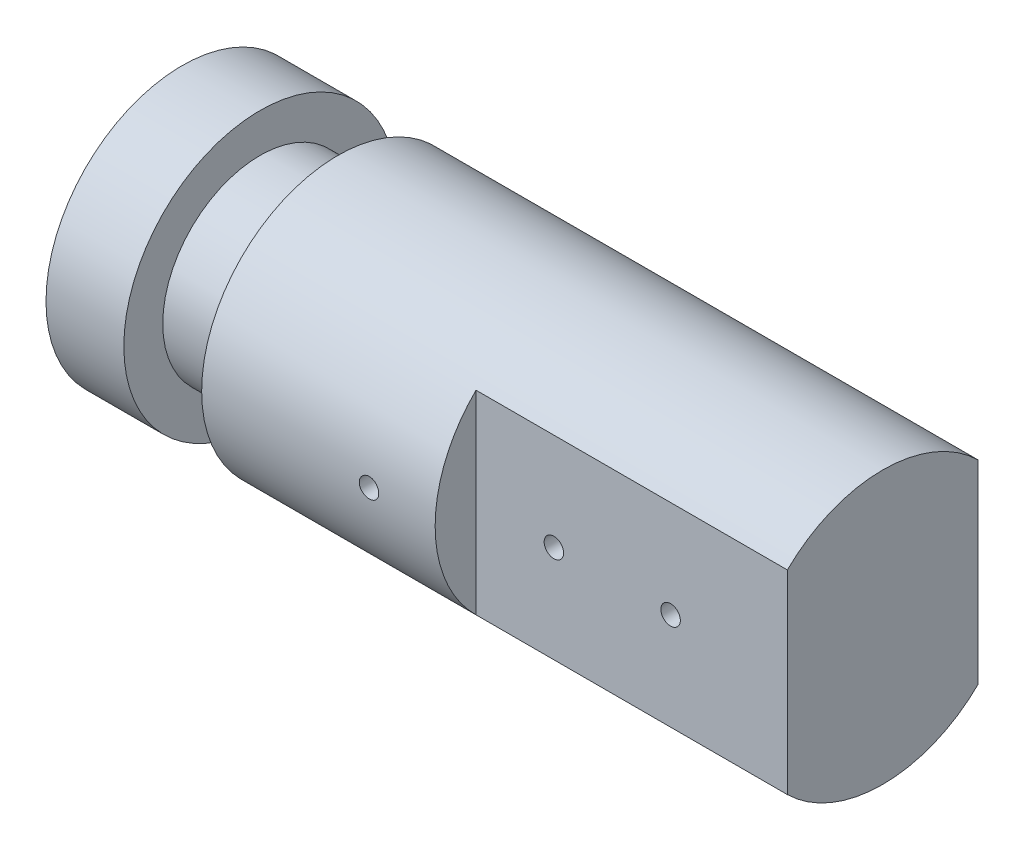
ISO-10303-21;
HEADER;
FILE_DESCRIPTION(('STEP AP214'),'2;1');
FILE_NAME('part.step','',(''),(''),'','','');
FILE_SCHEMA(('AUTOMOTIVE_DESIGN { 1 0 10303 214 1 1 1 1 }'));
ENDSEC;
DATA;
#1=APPLICATION_CONTEXT('core data for automotive mechanical design processes');
#2=APPLICATION_PROTOCOL_DEFINITION('international standard','automotive_design',2000,#1);
#3=PRODUCT_CONTEXT('',#1,'mechanical');
#4=PRODUCT('Part','Part','',(#3));
#5=PRODUCT_RELATED_PRODUCT_CATEGORY('part','',(#4));
#6=PRODUCT_DEFINITION_FORMATION('','',#4);
#7=PRODUCT_DEFINITION_CONTEXT('part definition',#1,'design');
#8=PRODUCT_DEFINITION('design','',#6,#7);
#9=PRODUCT_DEFINITION_SHAPE('','',#8);
#10=(LENGTH_UNIT() NAMED_UNIT(*) SI_UNIT(.MILLI.,.METRE.));
#11=(NAMED_UNIT(*) PLANE_ANGLE_UNIT() SI_UNIT($,.RADIAN.));
#12=(NAMED_UNIT(*) SI_UNIT($,.STERADIAN.) SOLID_ANGLE_UNIT());
#13=UNCERTAINTY_MEASURE_WITH_UNIT(LENGTH_MEASURE(1.E-05),#10,'distance_accuracy_value','');
#14=(GEOMETRIC_REPRESENTATION_CONTEXT(3) GLOBAL_UNCERTAINTY_ASSIGNED_CONTEXT((#13)) GLOBAL_UNIT_ASSIGNED_CONTEXT((#10,
#11,#12)) REPRESENTATION_CONTEXT('',''));
#15=CARTESIAN_POINT('',(0.,0.,0.));
#16=DIRECTION('',(0.,0.,1.));
#17=DIRECTION('',(1.,0.,0.));
#18=AXIS2_PLACEMENT_3D('',#15,#16,#17);
#19=CARTESIAN_POINT('',(50.,17.5,0.));
#20=DIRECTION('',(-1.,0.,0.));
#21=DIRECTION('',(0.,0.,1.));
#22=AXIS2_PLACEMENT_3D('',#19,#20,#21);
#23=PLANE('',#22);
#24=DIRECTION('',(0.,-1.,0.));
#25=VECTOR('',#24,1.);
#26=CARTESIAN_POINT('',(50.,-12.5,12.2474487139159));
#27=LINE('',#26,#25);
#28=CARTESIAN_POINT('',(50.,12.5,12.2474487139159));
#29=VERTEX_POINT('',#28);
#30=CARTESIAN_POINT('',(50.,-12.5,12.2474487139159));
#31=VERTEX_POINT('',#30);
#32=EDGE_CURVE('E139',#29,#31,#27,.T.);
#33=ORIENTED_EDGE('',*,*,#32,.F.);
#34=CARTESIAN_POINT('',(50.,0.,0.));
#35=DIRECTION('',(-1.,0.,0.));
#36=DIRECTION('',(0.,0.,1.));
#37=AXIS2_PLACEMENT_3D('',#34,#35,#36);
#38=CIRCLE('',#37,17.5);
#39=EDGE_CURVE('E62',#31,#29,#38,.T.);
#40=ORIENTED_EDGE('',*,*,#39,.F.);
#41=EDGE_LOOP('',(#33,#40));
#42=FACE_BOUND('',#41,.T.);
#43=ADVANCED_FACE('F43',(#42),#23,.F.);
#44=DIRECTION('',(0.,1.,0.));
#45=VECTOR('',#44,1.);
#46=CARTESIAN_POINT('',(50.,-12.5,-12.2474487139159));
#47=LINE('',#46,#45);
#48=CARTESIAN_POINT('',(50.,-12.5,-12.2474487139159));
#49=VERTEX_POINT('',#48);
#50=CARTESIAN_POINT('',(50.,12.5,-12.2474487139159));
#51=VERTEX_POINT('',#50);
#52=EDGE_CURVE('E69',#49,#51,#47,.T.);
#53=ORIENTED_EDGE('',*,*,#52,.F.);
#54=EDGE_CURVE('E163',#51,#49,#38,.T.);
#55=ORIENTED_EDGE('',*,*,#54,.F.);
#56=EDGE_LOOP('',(#53,#55));
#57=FACE_BOUND('',#56,.T.);
#58=ADVANCED_FACE('F237',(#57),#23,.F.);
#59=CARTESIAN_POINT('',(0.,0.,0.));
#60=DIRECTION('',(1.,0.,0.));
#61=DIRECTION('',(0.,0.,-1.));
#62=AXIS2_PLACEMENT_3D('',#59,#60,#61);
#63=PLANE('',#62);
#64=CARTESIAN_POINT('',(0.,0.,0.));
#65=DIRECTION('',(-1.,0.,0.));
#66=DIRECTION('',(0.,0.,1.));
#67=AXIS2_PLACEMENT_3D('',#64,#65,#66);
#68=CIRCLE('',#67,17.5);
#69=CARTESIAN_POINT('',(0.,0.,17.5));
#70=VERTEX_POINT('',#69);
#71=EDGE_CURVE('E56',#70,#70,#68,.T.);
#72=ORIENTED_EDGE('',*,*,#71,.T.);
#73=EDGE_LOOP('',(#72));
#74=FACE_BOUND('',#73,.T.);
#75=ADVANCED_FACE('F45',(#74),#63,.F.);
#76=CARTESIAN_POINT('',(0.,0.,0.));
#77=DIRECTION('',(-1.,0.,0.));
#78=DIRECTION('',(0.,0.,1.));
#79=AXIS2_PLACEMENT_3D('',#76,#77,#78);
#80=CYLINDRICAL_SURFACE('',#79,17.5);
#81=ORIENTED_EDGE('',*,*,#71,.F.);
#82=EDGE_LOOP('',(#81));
#83=FACE_BOUND('',#82,.T.);
#84=CARTESIAN_POINT('',(10.,0.,0.));
#85=DIRECTION('',(-1.,0.,0.));
#86=DIRECTION('',(0.,0.,1.));
#87=AXIS2_PLACEMENT_3D('',#84,#85,#86);
#88=CIRCLE('',#87,17.5);
#89=CARTESIAN_POINT('',(10.,0.,17.5));
#90=VERTEX_POINT('',#89);
#91=EDGE_CURVE('E173',#90,#90,#88,.T.);
#92=ORIENTED_EDGE('',*,*,#91,.T.);
#93=EDGE_LOOP('',(#92));
#94=FACE_BOUND('',#93,.T.);
#95=ADVANCED_FACE('F179',(#83,#94),#80,.T.);
#96=CARTESIAN_POINT('',(10.,17.5,0.));
#97=DIRECTION('',(-1.,0.,0.));
#98=DIRECTION('',(0.,0.,1.));
#99=AXIS2_PLACEMENT_3D('',#96,#97,#98);
#100=PLANE('',#99);
#101=ORIENTED_EDGE('',*,*,#91,.F.);
#102=EDGE_LOOP('',(#101));
#103=FACE_BOUND('',#102,.T.);
#104=CARTESIAN_POINT('',(10.,0.,0.));
#105=DIRECTION('',(-1.,0.,0.));
#106=DIRECTION('',(0.,0.,1.));
#107=AXIS2_PLACEMENT_3D('',#104,#105,#106);
#108=CIRCLE('',#107,12.5);
#109=CARTESIAN_POINT('',(10.,0.,12.5));
#110=VERTEX_POINT('',#109);
#111=EDGE_CURVE('E170',#110,#110,#108,.T.);
#112=ORIENTED_EDGE('',*,*,#111,.T.);
#113=EDGE_LOOP('',(#112));
#114=FACE_BOUND('',#113,.T.);
#115=ADVANCED_FACE('F182',(#103,#114),#100,.F.);
#116=CARTESIAN_POINT('',(0.,0.,0.));
#117=DIRECTION('',(-1.,0.,0.));
#118=DIRECTION('',(0.,0.,1.));
#119=AXIS2_PLACEMENT_3D('',#116,#117,#118);
#120=CYLINDRICAL_SURFACE('',#119,12.5);
#121=ORIENTED_EDGE('',*,*,#111,.F.);
#122=EDGE_LOOP('',(#121));
#123=FACE_BOUND('',#122,.T.);
#124=CARTESIAN_POINT('',(20.,0.,0.));
#125=DIRECTION('',(-1.,0.,0.));
#126=DIRECTION('',(0.,0.,1.));
#127=AXIS2_PLACEMENT_3D('',#124,#125,#126);
#128=CIRCLE('',#127,12.5);
#129=CARTESIAN_POINT('',(20.,0.,12.5));
#130=VERTEX_POINT('',#129);
#131=EDGE_CURVE('E167',#130,#130,#128,.T.);
#132=ORIENTED_EDGE('',*,*,#131,.T.);
#133=EDGE_LOOP('',(#132));
#134=FACE_BOUND('',#133,.T.);
#135=ADVANCED_FACE('F187',(#123,#134),#120,.T.);
#136=CARTESIAN_POINT('',(20.,12.5,0.));
#137=DIRECTION('',(1.,0.,0.));
#138=DIRECTION('',(0.,0.,-1.));
#139=AXIS2_PLACEMENT_3D('',#136,#137,#138);
#140=PLANE('',#139);
#141=ORIENTED_EDGE('',*,*,#131,.F.);
#142=EDGE_LOOP('',(#141));
#143=FACE_BOUND('',#142,.T.);
#144=CARTESIAN_POINT('',(20.,0.,0.));
#145=DIRECTION('',(-1.,0.,0.));
#146=DIRECTION('',(0.,0.,1.));
#147=AXIS2_PLACEMENT_3D('',#144,#145,#146);
#148=CIRCLE('',#147,17.5);
#149=CARTESIAN_POINT('',(20.,0.,17.5));
#150=VERTEX_POINT('',#149);
#151=EDGE_CURVE('E164',#150,#150,#148,.T.);
#152=ORIENTED_EDGE('',*,*,#151,.T.);
#153=EDGE_LOOP('',(#152));
#154=FACE_BOUND('',#153,.T.);
#155=ADVANCED_FACE('F193',(#143,#154),#140,.F.);
#156=CARTESIAN_POINT('',(0.,0.,0.));
#157=DIRECTION('',(-1.,0.,0.));
#158=DIRECTION('',(0.,0.,1.));
#159=AXIS2_PLACEMENT_3D('',#156,#157,#158);
#160=CYLINDRICAL_SURFACE('',#159,17.5);
#161=CARTESIAN_POINT('',(42.75,0.,17.5));
#162=CARTESIAN_POINT('',(42.7499969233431,-0.0701171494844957,17.4999994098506));
#163=CARTESIAN_POINT('',(42.7440804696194,-0.14028285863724,17.4995740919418));
#164=CARTESIAN_POINT('',(42.7205643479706,-0.278675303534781,17.4979183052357));
#165=CARTESIAN_POINT('',(42.7029512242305,-0.346899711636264,17.4966869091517));
#166=CARTESIAN_POINT('',(42.6565515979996,-0.479385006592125,17.4935582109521));
#167=CARTESIAN_POINT('',(42.6277711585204,-0.54364802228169,17.4916612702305));
#168=CARTESIAN_POINT('',(42.5598641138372,-0.666414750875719,17.4874145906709));
#169=CARTESIAN_POINT('',(42.5207398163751,-0.724919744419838,17.4850649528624));
#170=CARTESIAN_POINT('',(42.4331742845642,-0.834637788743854,17.4801717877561));
#171=CARTESIAN_POINT('',(42.3847174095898,-0.885838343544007,17.4776279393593));
#172=CARTESIAN_POINT('',(42.2798948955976,-0.979387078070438,17.4726357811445));
#173=CARTESIAN_POINT('',(42.2235289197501,-1.02173488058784,17.4701874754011));
#174=CARTESIAN_POINT('',(42.1044150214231,-1.09641641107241,17.4656599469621));
#175=CARTESIAN_POINT('',(42.0416603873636,-1.12873946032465,17.4635811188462));
#176=CARTESIAN_POINT('',(41.9115974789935,-1.18238568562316,17.4600312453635));
#177=CARTESIAN_POINT('',(41.8442892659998,-1.20370900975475,17.4585601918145));
#178=CARTESIAN_POINT('',(41.7071526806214,-1.23471502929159,17.4563948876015));
#179=CARTESIAN_POINT('',(41.6373288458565,-1.24441769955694,17.4556993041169));
#180=CARTESIAN_POINT('',(41.4970403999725,-1.25196866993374,17.4551593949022));
#181=CARTESIAN_POINT('',(41.4265757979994,-1.24981713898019,17.4553150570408));
#182=CARTESIAN_POINT('',(41.2871424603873,-1.23373732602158,17.4564588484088));
#183=CARTESIAN_POINT('',(41.2181712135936,-1.21983069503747,17.4574454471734));
#184=CARTESIAN_POINT('',(41.0835444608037,-1.18066904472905,17.4601375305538));
#185=CARTESIAN_POINT('',(41.0178889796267,-1.15541394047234,17.46184302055));
#186=CARTESIAN_POINT('',(40.8916881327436,-1.09424779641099,17.4657824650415));
#187=CARTESIAN_POINT('',(40.8311475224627,-1.05832697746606,17.4680169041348));
#188=CARTESIAN_POINT('',(40.7169469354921,-0.976856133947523,17.4727619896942));
#189=CARTESIAN_POINT('',(40.6632870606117,-0.931305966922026,17.475272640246));
#190=CARTESIAN_POINT('',(40.5642452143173,-0.831747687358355,17.4802940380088));
#191=CARTESIAN_POINT('',(40.5188820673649,-0.777720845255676,17.4828047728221));
#192=CARTESIAN_POINT('',(40.4378667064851,-0.662808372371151,17.4875380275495));
#193=CARTESIAN_POINT('',(40.4022144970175,-0.60192273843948,17.4897605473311));
#194=CARTESIAN_POINT('',(40.3416344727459,-0.475009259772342,17.4936672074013));
#195=CARTESIAN_POINT('',(40.3167074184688,-0.408981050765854,17.4953513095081));
#196=CARTESIAN_POINT('',(40.2782981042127,-0.273662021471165,17.4979908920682));
#197=CARTESIAN_POINT('',(40.2648156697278,-0.204371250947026,17.4989463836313));
#198=CARTESIAN_POINT('',(40.2497017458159,-0.0646572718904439,17.5000196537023));
#199=CARTESIAN_POINT('',(40.2480442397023,0.00576310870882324,17.5001392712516));
#200=CARTESIAN_POINT('',(40.2565591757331,0.145880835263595,17.4995322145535));
#201=CARTESIAN_POINT('',(40.266731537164,0.215578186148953,17.4988055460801));
#202=CARTESIAN_POINT('',(40.2985959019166,0.352197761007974,17.4965888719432));
#203=CARTESIAN_POINT('',(40.3202759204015,0.419122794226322,17.4950996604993));
#204=CARTESIAN_POINT('',(40.3745279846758,0.548384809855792,17.4915253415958));
#205=CARTESIAN_POINT('',(40.4071001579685,0.61072173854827,17.4894402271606));
#206=CARTESIAN_POINT('',(40.4822778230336,0.729156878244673,17.4849035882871));
#207=CARTESIAN_POINT('',(40.5249006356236,0.785244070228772,17.4824514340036));
#208=CARTESIAN_POINT('',(40.6189445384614,0.889476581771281,17.4774586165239));
#209=CARTESIAN_POINT('',(40.6703657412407,0.937621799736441,17.474917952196));
#210=CARTESIAN_POINT('',(40.7806592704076,1.02469226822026,17.4700290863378));
#211=CARTESIAN_POINT('',(40.8395449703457,1.06360060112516,17.4676812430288));
#212=CARTESIAN_POINT('',(40.9630289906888,1.1309770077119,17.4634485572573));
#213=CARTESIAN_POINT('',(41.0276272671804,1.15944516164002,17.4615637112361));
#214=CARTESIAN_POINT('',(41.1606416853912,1.20510399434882,17.4584721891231));
#215=CARTESIAN_POINT('',(41.229054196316,1.2223052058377,17.4572648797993));
#216=CARTESIAN_POINT('',(41.3678052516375,1.24497623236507,17.4556628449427));
#217=CARTESIAN_POINT('',(41.4381437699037,1.25044620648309,17.4552681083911));
#218=CARTESIAN_POINT('',(41.5785820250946,1.24949784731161,17.4553360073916));
#219=CARTESIAN_POINT('',(41.6486819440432,1.2431061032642,17.4557967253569));
#220=CARTESIAN_POINT('',(41.7868103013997,1.21867099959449,17.457519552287));
#221=CARTESIAN_POINT('',(41.8548387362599,1.20062762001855,17.4587816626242));
#222=CARTESIAN_POINT('',(41.9868960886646,1.15340774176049,17.4619645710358));
#223=CARTESIAN_POINT('',(42.0509251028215,1.12423151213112,17.4638853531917));
#224=CARTESIAN_POINT('',(42.1731798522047,1.05557743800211,17.4681691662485));
#225=CARTESIAN_POINT('',(42.2314057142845,1.01609981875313,17.4705321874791));
#226=CARTESIAN_POINT('',(42.3405368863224,0.927864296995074,17.4754404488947));
#227=CARTESIAN_POINT('',(42.3914264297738,0.879086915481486,17.4779860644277));
#228=CARTESIAN_POINT('',(42.4843140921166,0.7736676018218,17.4829693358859));
#229=CARTESIAN_POINT('',(42.5263100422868,0.717023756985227,17.4854069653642));
#230=CARTESIAN_POINT('',(42.6002591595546,0.597397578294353,17.4899028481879));
#231=CARTESIAN_POINT('',(42.6321973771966,0.534405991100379,17.4919605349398));
#232=CARTESIAN_POINT('',(42.6850042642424,0.403984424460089,17.4954575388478));
#233=CARTESIAN_POINT('',(42.7058858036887,0.336559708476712,17.4968975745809));
#234=CARTESIAN_POINT('',(42.7306021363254,0.223940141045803,17.4986226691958));
#235=CARTESIAN_POINT('',(42.737866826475,0.179471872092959,17.4991368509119));
#236=CARTESIAN_POINT('',(42.7475667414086,0.0900090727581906,17.4998257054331));
#237=CARTESIAN_POINT('',(42.7500019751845,0.0450145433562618,17.5000003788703));
#238=CARTESIAN_POINT('',(42.75,0.,17.5));
#239=B_SPLINE_CURVE_WITH_KNOTS('',3,(#161,#162,#163,#164,#165,#166,#167,#168,#169,#170,#171,
#172,#173,#174,#175,#176,#177,#178,#179,#180,#181,#182,#183,#184,#185,#186,#187,#188,#189,#190,
#191,#192,#193,#194,#195,#196,#197,#198,#199,#200,#201,#202,#203,#204,#205,#206,#207,#208,#209,
#210,#211,#212,#213,#214,#215,#216,#217,#218,#219,#220,#221,#222,#223,#224,#225,#226,#227,#228,
#229,#230,#231,#232,#233,#234,#235,#236,#237,#238),.UNSPECIFIED.,.T.,.F.,(4,2,2,2,2,2,2,2,2,2,2,
2,2,2,2,2,2,2,2,2,2,2,2,2,2,2,2,2,2,2,2,2,2,2,2,2,2,2,4),(0.,0.210187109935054,
0.420616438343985,0.630931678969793,0.841200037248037,1.0518239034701,1.26245674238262,
1.47331319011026,1.68416679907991,1.89465744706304,2.10514509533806,2.31524590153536,
2.52534828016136,2.73564389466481,2.94594262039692,3.15671272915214,3.36748293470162,
3.57826808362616,3.78905001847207,3.99936805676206,4.2096846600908,4.41978265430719,
4.62988310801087,4.84034832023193,5.05081622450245,5.26166668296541,5.47251552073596,
5.68316696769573,5.89381555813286,6.10399252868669,6.31416985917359,6.52434211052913,
6.73450976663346,6.94512256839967,7.15578666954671,7.36676243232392,7.57749207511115,
7.71243045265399,7.84736857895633),.UNSPECIFIED.);
#240=CARTESIAN_POINT('',(42.75,0.,17.5));
#241=VERTEX_POINT('',#240);
#242=EDGE_CURVE('E11',#241,#241,#239,.T.);
#243=ORIENTED_EDGE('',*,*,#242,.T.);
#244=EDGE_LOOP('',(#243));
#245=FACE_BOUND('',#244,.T.);
#246=ORIENTED_EDGE('',*,*,#151,.F.);
#247=EDGE_LOOP('',(#246));
#248=FACE_BOUND('',#247,.T.);
#249=ORIENTED_EDGE('',*,*,#39,.T.);
#250=DIRECTION('',(-1.,0.,0.));
#251=VECTOR('',#250,1.);
#252=CARTESIAN_POINT('',(90.,12.5,12.2474487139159));
#253=LINE('',#252,#251);
#254=CARTESIAN_POINT('',(90.,12.5,12.2474487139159));
#255=VERTEX_POINT('',#254);
#256=EDGE_CURVE('E150',#255,#29,#253,.T.);
#257=ORIENTED_EDGE('',*,*,#256,.F.);
#258=CARTESIAN_POINT('',(90.,0.,0.));
#259=DIRECTION('',(1.,0.,0.));
#260=DIRECTION('',(0.,0.,-1.));
#261=AXIS2_PLACEMENT_3D('',#258,#259,#260);
#262=CIRCLE('',#261,17.5);
#263=CARTESIAN_POINT('',(90.,12.5,-12.2474487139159));
#264=VERTEX_POINT('',#263);
#265=EDGE_CURVE('E141',#264,#255,#262,.T.);
#266=ORIENTED_EDGE('',*,*,#265,.F.);
#267=DIRECTION('',(-1.,0.,0.));
#268=VECTOR('',#267,1.);
#269=CARTESIAN_POINT('',(90.,12.5,-12.2474487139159));
#270=LINE('',#269,#268);
#271=EDGE_CURVE('E153',#264,#51,#270,.T.);
#272=ORIENTED_EDGE('',*,*,#271,.T.);
#273=ORIENTED_EDGE('',*,*,#54,.T.);
#274=DIRECTION('',(-1.,0.,0.));
#275=VECTOR('',#274,1.);
#276=CARTESIAN_POINT('',(90.,-12.5,-12.2474487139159));
#277=LINE('',#276,#275);
#278=CARTESIAN_POINT('',(90.,-12.5,-12.2474487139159));
#279=VERTEX_POINT('',#278);
#280=EDGE_CURVE('E156',#279,#49,#277,.T.);
#281=ORIENTED_EDGE('',*,*,#280,.F.);
#282=CARTESIAN_POINT('',(90.,0.,0.));
#283=DIRECTION('',(1.,0.,0.));
#284=DIRECTION('',(0.,0.,-1.));
#285=AXIS2_PLACEMENT_3D('',#282,#283,#284);
#286=CIRCLE('',#285,17.5);
#287=CARTESIAN_POINT('',(90.,-12.5,12.2474487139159));
#288=VERTEX_POINT('',#287);
#289=EDGE_CURVE('E135',#288,#279,#286,.T.);
#290=ORIENTED_EDGE('',*,*,#289,.F.);
#291=DIRECTION('',(-1.,0.,0.));
#292=VECTOR('',#291,1.);
#293=CARTESIAN_POINT('',(90.,-12.5,12.2474487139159));
#294=LINE('',#293,#292);
#295=EDGE_CURVE('E145',#288,#31,#294,.T.);
#296=ORIENTED_EDGE('',*,*,#295,.T.);
#297=EDGE_LOOP('',(#249,#257,#266,#272,#273,#281,#290,#296));
#298=FACE_BOUND('',#297,.T.);
#299=ADVANCED_FACE('F199',(#245,#248,#298),#160,.T.);
#300=CARTESIAN_POINT('',(41.5,0.,17.5));
#301=DIRECTION('',(0.,0.,1.));
#302=DIRECTION('',(1.,0.,0.));
#303=AXIS2_PLACEMENT_3D('',#300,#301,#302);
#304=CYLINDRICAL_SURFACE('',#303,1.25);
#305=CARTESIAN_POINT('',(41.5,0.,14.2510757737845));
#306=DIRECTION('',(0.,0.,1.));
#307=DIRECTION('',(1.,0.,0.));
#308=AXIS2_PLACEMENT_3D('',#305,#306,#307);
#309=CIRCLE('',#308,1.25);
#310=CARTESIAN_POINT('',(42.75,0.,14.2510757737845));
#311=VERTEX_POINT('',#310);
#312=EDGE_CURVE('E159',#311,#311,#309,.T.);
#313=ORIENTED_EDGE('',*,*,#312,.F.);
#314=EDGE_LOOP('',(#313));
#315=FACE_BOUND('',#314,.T.);
#316=ORIENTED_EDGE('',*,*,#242,.F.);
#317=EDGE_LOOP('',(#316));
#318=FACE_BOUND('',#317,.T.);
#319=ADVANCED_FACE('F205',(#315,#318),#304,.F.);
#320=CARTESIAN_POINT('',(41.5,0.,14.2510757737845));
#321=DIRECTION('',(0.,0.,1.));
#322=DIRECTION('',(1.,0.,0.));
#323=AXIS2_PLACEMENT_3D('',#320,#321,#322);
#324=CONICAL_SURFACE('',#323,1.25,1.02974425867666);
#325=CARTESIAN_POINT('',(41.5,0.,13.5));
#326=VERTEX_POINT('',#325);
#327=VERTEX_LOOP('',#326);
#328=FACE_BOUND('',#327,.T.);
#329=ORIENTED_EDGE('',*,*,#312,.T.);
#330=EDGE_LOOP('',(#329));
#331=FACE_BOUND('',#330,.T.);
#332=ADVANCED_FACE('F221',(#328,#331),#324,.F.);
#333=CARTESIAN_POINT('',(90.,-12.5,-12.2474487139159));
#334=DIRECTION('',(0.,0.,1.));
#335=DIRECTION('',(1.,0.,0.));
#336=AXIS2_PLACEMENT_3D('',#333,#334,#335);
#337=PLANE('',#336);
#338=CARTESIAN_POINT('',(75.,0.,-12.2474487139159));
#339=DIRECTION('',(0.,0.,-1.));
#340=DIRECTION('',(-1.,0.,0.));
#341=AXIS2_PLACEMENT_3D('',#338,#339,#340);
#342=CIRCLE('',#341,1.24999999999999);
#343=CARTESIAN_POINT('',(73.75,0.,-12.2474487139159));
#344=VERTEX_POINT('',#343);
#345=EDGE_CURVE('E123',#344,#344,#342,.T.);
#346=ORIENTED_EDGE('',*,*,#345,.F.);
#347=EDGE_LOOP('',(#346));
#348=FACE_BOUND('',#347,.T.);
#349=CARTESIAN_POINT('',(60.,0.,-12.2474487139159));
#350=DIRECTION('',(0.,0.,-1.));
#351=DIRECTION('',(-1.,0.,0.));
#352=AXIS2_PLACEMENT_3D('',#349,#350,#351);
#353=CIRCLE('',#352,1.24999999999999);
#354=CARTESIAN_POINT('',(58.75,0.,-12.2474487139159));
#355=VERTEX_POINT('',#354);
#356=EDGE_CURVE('E129',#355,#355,#353,.T.);
#357=ORIENTED_EDGE('',*,*,#356,.F.);
#358=EDGE_LOOP('',(#357));
#359=FACE_BOUND('',#358,.T.);
#360=ORIENTED_EDGE('',*,*,#52,.T.);
#361=ORIENTED_EDGE('',*,*,#271,.F.);
#362=DIRECTION('',(0.,1.,0.));
#363=VECTOR('',#362,1.);
#364=CARTESIAN_POINT('',(90.,-12.5,-12.2474487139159));
#365=LINE('',#364,#363);
#366=EDGE_CURVE('E138',#279,#264,#365,.T.);
#367=ORIENTED_EDGE('',*,*,#366,.F.);
#368=ORIENTED_EDGE('',*,*,#280,.T.);
#369=EDGE_LOOP('',(#360,#361,#367,#368));
#370=FACE_BOUND('',#369,.T.);
#371=ADVANCED_FACE('F219',(#348,#359,#370),#337,.F.);
#372=CARTESIAN_POINT('',(90.,-12.5,12.2474487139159));
#373=DIRECTION('',(0.,0.,-1.));
#374=DIRECTION('',(-1.,0.,0.));
#375=AXIS2_PLACEMENT_3D('',#372,#373,#374);
#376=PLANE('',#375);
#377=CARTESIAN_POINT('',(60.,0.,12.2474487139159));
#378=DIRECTION('',(0.,0.,1.));
#379=DIRECTION('',(1.,0.,0.));
#380=AXIS2_PLACEMENT_3D('',#377,#378,#379);
#381=CIRCLE('',#380,1.24999999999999);
#382=CARTESIAN_POINT('',(61.25,0.,12.2474487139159));
#383=VERTEX_POINT('',#382);
#384=EDGE_CURVE('E113',#383,#383,#381,.T.);
#385=ORIENTED_EDGE('',*,*,#384,.F.);
#386=EDGE_LOOP('',(#385));
#387=FACE_BOUND('',#386,.T.);
#388=CARTESIAN_POINT('',(75.,0.,12.2474487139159));
#389=DIRECTION('',(0.,0.,1.));
#390=DIRECTION('',(1.,0.,0.));
#391=AXIS2_PLACEMENT_3D('',#388,#389,#390);
#392=CIRCLE('',#391,1.24999999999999);
#393=CARTESIAN_POINT('',(76.25,0.,12.2474487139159));
#394=VERTEX_POINT('',#393);
#395=EDGE_CURVE('E112',#394,#394,#392,.T.);
#396=ORIENTED_EDGE('',*,*,#395,.F.);
#397=EDGE_LOOP('',(#396));
#398=FACE_BOUND('',#397,.T.);
#399=ORIENTED_EDGE('',*,*,#32,.T.);
#400=ORIENTED_EDGE('',*,*,#295,.F.);
#401=DIRECTION('',(0.,-1.,0.));
#402=VECTOR('',#401,1.);
#403=CARTESIAN_POINT('',(90.,-12.5,12.2474487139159));
#404=LINE('',#403,#402);
#405=EDGE_CURVE('E143',#255,#288,#404,.T.);
#406=ORIENTED_EDGE('',*,*,#405,.F.);
#407=ORIENTED_EDGE('',*,*,#256,.T.);
#408=EDGE_LOOP('',(#399,#400,#406,#407));
#409=FACE_BOUND('',#408,.T.);
#410=ADVANCED_FACE('F213',(#387,#398,#409),#376,.F.);
#411=CARTESIAN_POINT('',(90.,0.,0.));
#412=DIRECTION('',(1.,0.,0.));
#413=DIRECTION('',(0.,0.,-1.));
#414=AXIS2_PLACEMENT_3D('',#411,#412,#413);
#415=PLANE('',#414);
#416=ORIENTED_EDGE('',*,*,#289,.T.);
#417=ORIENTED_EDGE('',*,*,#366,.T.);
#418=ORIENTED_EDGE('',*,*,#265,.T.);
#419=ORIENTED_EDGE('',*,*,#405,.T.);
#420=EDGE_LOOP('',(#416,#417,#418,#419));
#421=FACE_BOUND('',#420,.T.);
#422=ADVANCED_FACE('F215',(#421),#415,.T.);
#423=CARTESIAN_POINT('',(60.,0.,-7.24744871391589));
#424=DIRECTION('',(0.,0.,-1.));
#425=DIRECTION('',(-1.,0.,0.));
#426=AXIS2_PLACEMENT_3D('',#423,#424,#425);
#427=CONICAL_SURFACE('',#426,1.25,1.02974425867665);
#428=CARTESIAN_POINT('',(60.,0.,-6.49637294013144));
#429=VERTEX_POINT('',#428);
#430=VERTEX_LOOP('',#429);
#431=FACE_BOUND('',#430,.T.);
#432=CARTESIAN_POINT('',(60.,0.,-7.24744871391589));
#433=DIRECTION('',(0.,0.,-1.));
#434=DIRECTION('',(-1.,0.,0.));
#435=AXIS2_PLACEMENT_3D('',#432,#433,#434);
#436=CIRCLE('',#435,1.25);
#437=CARTESIAN_POINT('',(58.75,0.,-7.24744871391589));
#438=VERTEX_POINT('',#437);
#439=EDGE_CURVE('E132',#438,#438,#436,.T.);
#440=ORIENTED_EDGE('',*,*,#439,.T.);
#441=EDGE_LOOP('',(#440));
#442=FACE_BOUND('',#441,.T.);
#443=ADVANCED_FACE('F285',(#431,#442),#427,.F.);
#444=CARTESIAN_POINT('',(60.,0.,-12.2474487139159));
#445=DIRECTION('',(0.,0.,-1.));
#446=DIRECTION('',(-1.,0.,0.));
#447=AXIS2_PLACEMENT_3D('',#444,#445,#446);
#448=CYLINDRICAL_SURFACE('',#447,1.24999999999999);
#449=ORIENTED_EDGE('',*,*,#439,.F.);
#450=EDGE_LOOP('',(#449));
#451=FACE_BOUND('',#450,.T.);
#452=ORIENTED_EDGE('',*,*,#356,.T.);
#453=EDGE_LOOP('',(#452));
#454=FACE_BOUND('',#453,.T.);
#455=ADVANCED_FACE('F280',(#451,#454),#448,.F.);
#456=CARTESIAN_POINT('',(75.,0.,-7.24744871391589));
#457=DIRECTION('',(0.,0.,-1.));
#458=DIRECTION('',(-1.,0.,0.));
#459=AXIS2_PLACEMENT_3D('',#456,#457,#458);
#460=CONICAL_SURFACE('',#459,1.25,1.02974425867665);
#461=CARTESIAN_POINT('',(75.,0.,-6.49637294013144));
#462=VERTEX_POINT('',#461);
#463=VERTEX_LOOP('',#462);
#464=FACE_BOUND('',#463,.T.);
#465=CARTESIAN_POINT('',(75.,0.,-7.24744871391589));
#466=DIRECTION('',(0.,0.,-1.));
#467=DIRECTION('',(-1.,0.,0.));
#468=AXIS2_PLACEMENT_3D('',#465,#466,#467);
#469=CIRCLE('',#468,1.25);
#470=CARTESIAN_POINT('',(73.75,0.,-7.24744871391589));
#471=VERTEX_POINT('',#470);
#472=EDGE_CURVE('E126',#471,#471,#469,.T.);
#473=ORIENTED_EDGE('',*,*,#472,.T.);
#474=EDGE_LOOP('',(#473));
#475=FACE_BOUND('',#474,.T.);
#476=ADVANCED_FACE('F284',(#464,#475),#460,.F.);
#477=CARTESIAN_POINT('',(75.,0.,-12.2474487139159));
#478=DIRECTION('',(0.,0.,-1.));
#479=DIRECTION('',(-1.,0.,0.));
#480=AXIS2_PLACEMENT_3D('',#477,#478,#479);
#481=CYLINDRICAL_SURFACE('',#480,1.24999999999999);
#482=ORIENTED_EDGE('',*,*,#472,.F.);
#483=EDGE_LOOP('',(#482));
#484=FACE_BOUND('',#483,.T.);
#485=ORIENTED_EDGE('',*,*,#345,.T.);
#486=EDGE_LOOP('',(#485));
#487=FACE_BOUND('',#486,.T.);
#488=ADVANCED_FACE('F295',(#484,#487),#481,.F.);
#489=CARTESIAN_POINT('',(75.,0.,7.2474487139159));
#490=DIRECTION('',(0.,0.,1.));
#491=DIRECTION('',(1.,0.,0.));
#492=AXIS2_PLACEMENT_3D('',#489,#490,#491);
#493=CONICAL_SURFACE('',#492,1.25,1.02974425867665);
#494=CARTESIAN_POINT('',(75.,0.,6.49637294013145));
#495=VERTEX_POINT('',#494);
#496=VERTEX_LOOP('',#495);
#497=FACE_BOUND('',#496,.T.);
#498=CARTESIAN_POINT('',(75.,0.,7.2474487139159));
#499=DIRECTION('',(0.,0.,1.));
#500=DIRECTION('',(1.,0.,0.));
#501=AXIS2_PLACEMENT_3D('',#498,#499,#500);
#502=CIRCLE('',#501,1.25);
#503=CARTESIAN_POINT('',(76.25,0.,7.2474487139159));
#504=VERTEX_POINT('',#503);
#505=EDGE_CURVE('E116',#504,#504,#502,.T.);
#506=ORIENTED_EDGE('',*,*,#505,.T.);
#507=EDGE_LOOP('',(#506));
#508=FACE_BOUND('',#507,.T.);
#509=ADVANCED_FACE('F298',(#497,#508),#493,.F.);
#510=CARTESIAN_POINT('',(75.,0.,12.2474487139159));
#511=DIRECTION('',(0.,0.,1.));
#512=DIRECTION('',(1.,0.,0.));
#513=AXIS2_PLACEMENT_3D('',#510,#511,#512);
#514=CYLINDRICAL_SURFACE('',#513,1.24999999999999);
#515=ORIENTED_EDGE('',*,*,#505,.F.);
#516=EDGE_LOOP('',(#515));
#517=FACE_BOUND('',#516,.T.);
#518=ORIENTED_EDGE('',*,*,#395,.T.);
#519=EDGE_LOOP('',(#518));
#520=FACE_BOUND('',#519,.T.);
#521=ADVANCED_FACE('F106',(#517,#520),#514,.F.);
#522=CARTESIAN_POINT('',(60.,0.,7.2474487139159));
#523=DIRECTION('',(0.,0.,1.));
#524=DIRECTION('',(1.,0.,0.));
#525=AXIS2_PLACEMENT_3D('',#522,#523,#524);
#526=CONICAL_SURFACE('',#525,1.25,1.02974425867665);
#527=CARTESIAN_POINT('',(60.,0.,6.49637294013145));
#528=VERTEX_POINT('',#527);
#529=VERTEX_LOOP('',#528);
#530=FACE_BOUND('',#529,.T.);
#531=CARTESIAN_POINT('',(60.,0.,7.2474487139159));
#532=DIRECTION('',(0.,0.,1.));
#533=DIRECTION('',(1.,0.,0.));
#534=AXIS2_PLACEMENT_3D('',#531,#532,#533);
#535=CIRCLE('',#534,1.25);
#536=CARTESIAN_POINT('',(61.25,0.,7.2474487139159));
#537=VERTEX_POINT('',#536);
#538=EDGE_CURVE('E110',#537,#537,#535,.T.);
#539=ORIENTED_EDGE('',*,*,#538,.T.);
#540=EDGE_LOOP('',(#539));
#541=FACE_BOUND('',#540,.T.);
#542=ADVANCED_FACE('F102',(#530,#541),#526,.F.);
#543=CARTESIAN_POINT('',(60.,0.,12.2474487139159));
#544=DIRECTION('',(0.,0.,1.));
#545=DIRECTION('',(1.,0.,0.));
#546=AXIS2_PLACEMENT_3D('',#543,#544,#545);
#547=CYLINDRICAL_SURFACE('',#546,1.24999999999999);
#548=ORIENTED_EDGE('',*,*,#538,.F.);
#549=EDGE_LOOP('',(#548));
#550=FACE_BOUND('',#549,.T.);
#551=ORIENTED_EDGE('',*,*,#384,.T.);
#552=EDGE_LOOP('',(#551));
#553=FACE_BOUND('',#552,.T.);
#554=ADVANCED_FACE('F105',(#550,#553),#547,.F.);
#555=CLOSED_SHELL('',(#43,#58,#75,#95,#115,#135,#155,#299,#319,#332,#371,#410,#422,#443,#455,
#476,#488,#509,#521,#542,#554));
#556=MANIFOLD_SOLID_BREP('B2',#555);
#557=ADVANCED_BREP_SHAPE_REPRESENTATION('',(#18,#556),#14);
#558=SHAPE_DEFINITION_REPRESENTATION(#9,#557);
ENDSEC;
END-ISO-10303-21;
